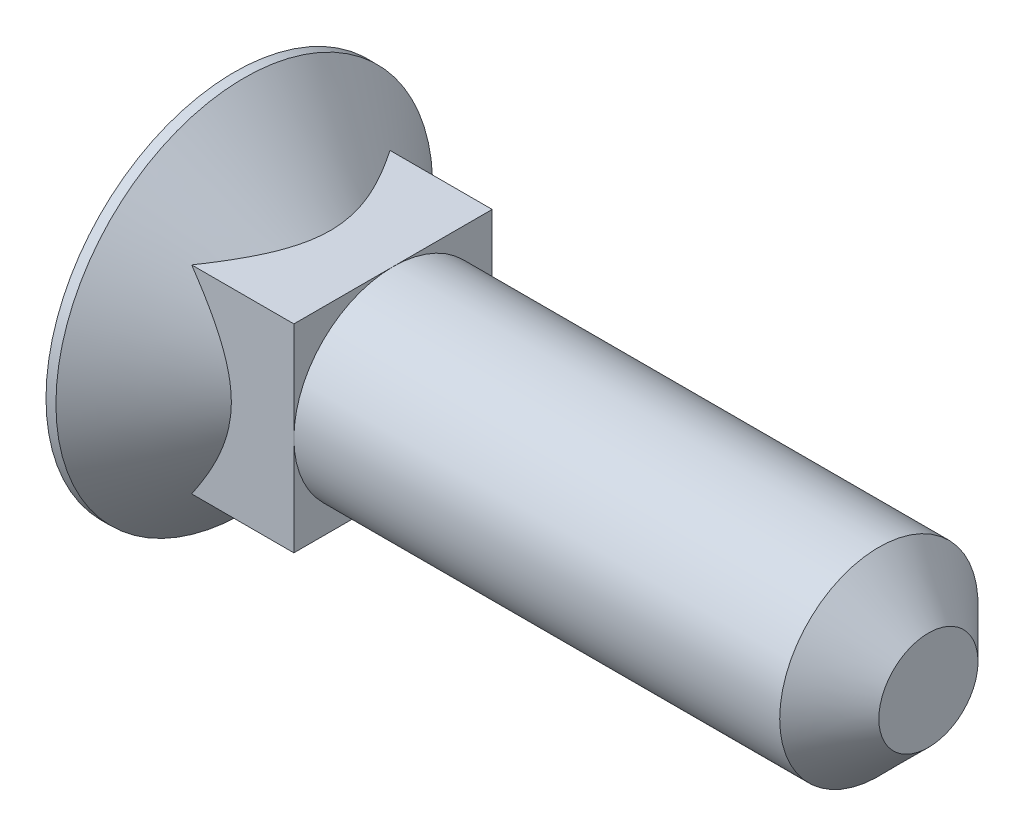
ISO-10303-21;
HEADER;
FILE_DESCRIPTION(('STEP AP214'),'2;1');
FILE_NAME('part.step','',(''),(''),'','','');
FILE_SCHEMA(('AUTOMOTIVE_DESIGN { 1 0 10303 214 1 1 1 1 }'));
ENDSEC;
DATA;
#1=APPLICATION_CONTEXT('core data for automotive mechanical design processes');
#2=APPLICATION_PROTOCOL_DEFINITION('international standard','automotive_design',2000,#1);
#3=PRODUCT_CONTEXT('',#1,'mechanical');
#4=PRODUCT('Part','Part','',(#3));
#5=PRODUCT_RELATED_PRODUCT_CATEGORY('part','',(#4));
#6=PRODUCT_DEFINITION_FORMATION('','',#4);
#7=PRODUCT_DEFINITION_CONTEXT('part definition',#1,'design');
#8=PRODUCT_DEFINITION('design','',#6,#7);
#9=PRODUCT_DEFINITION_SHAPE('','',#8);
#10=(LENGTH_UNIT() NAMED_UNIT(*) SI_UNIT(.MILLI.,.METRE.));
#11=(NAMED_UNIT(*) PLANE_ANGLE_UNIT() SI_UNIT($,.RADIAN.));
#12=(NAMED_UNIT(*) SI_UNIT($,.STERADIAN.) SOLID_ANGLE_UNIT());
#13=UNCERTAINTY_MEASURE_WITH_UNIT(LENGTH_MEASURE(1.E-05),#10,'distance_accuracy_value','');
#14=(GEOMETRIC_REPRESENTATION_CONTEXT(3) GLOBAL_UNCERTAINTY_ASSIGNED_CONTEXT((#13)) GLOBAL_UNIT_ASSIGNED_CONTEXT((#10,
#11,#12)) REPRESENTATION_CONTEXT('',''));
#15=CARTESIAN_POINT('',(0.,0.,0.));
#16=DIRECTION('',(0.,0.,1.));
#17=DIRECTION('',(1.,0.,0.));
#18=AXIS2_PLACEMENT_3D('',#15,#16,#17);
#19=CARTESIAN_POINT('',(4.84559948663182,0.,0.));
#20=DIRECTION('',(-1.,0.,0.));
#21=DIRECTION('',(0.,0.,1.));
#22=AXIS2_PLACEMENT_3D('',#19,#20,#21);
#23=CONICAL_SURFACE('',#22,5.,0.802851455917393);
#24=CARTESIAN_POINT('',(0.5,0.,0.));
#25=DIRECTION('',(-1.,0.,0.));
#26=DIRECTION('',(0.,0.,1.));
#27=AXIS2_PLACEMENT_3D('',#24,#25,#26);
#28=CIRCLE('',#27,9.5);
#29=CARTESIAN_POINT('',(0.5,0.,9.5));
#30=VERTEX_POINT('',#29);
#31=EDGE_CURVE('E169',#30,#30,#28,.T.);
#32=ORIENTED_EDGE('',*,*,#31,.F.);
#33=EDGE_LOOP('',(#32));
#34=FACE_BOUND('',#33,.T.);
#35=CARTESIAN_POINT('',(-0.712879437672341,-9.52318036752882,5.));
#36=CARTESIAN_POINT('',(-0.521841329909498,-9.29970864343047,5.));
#37=CARTESIAN_POINT('',(-0.331604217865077,-9.07554518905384,5.));
#38=CARTESIAN_POINT('',(0.0468371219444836,-8.62546566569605,5.));
#39=CARTESIAN_POINT('',(0.235041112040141,-8.39954939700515,5.));
#40=CARTESIAN_POINT('',(0.609827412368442,-7.94457044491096,5.));
#41=CARTESIAN_POINT('',(0.796397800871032,-7.71549792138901,5.));
#42=CARTESIAN_POINT('',(1.16634363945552,-7.25480211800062,5.));
#43=CARTESIAN_POINT('',(1.34971925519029,-7.02317897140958,5.));
#44=CARTESIAN_POINT('',(1.72370413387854,-6.54223881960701,5.));
#45=CARTESIAN_POINT('',(1.91405255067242,-6.29271831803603,5.));
#46=CARTESIAN_POINT('',(2.2887107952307,-5.78910009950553,5.));
#47=CARTESIAN_POINT('',(2.47301966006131,-5.53500166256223,5.));
#48=CARTESIAN_POINT('',(2.83301836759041,-5.02149983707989,5.));
#49=CARTESIAN_POINT('',(3.00872474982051,-4.76210810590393,5.));
#50=CARTESIAN_POINT('',(3.34861760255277,-4.23592686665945,5.));
#51=CARTESIAN_POINT('',(3.51280858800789,-3.96914031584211,5.));
#52=CARTESIAN_POINT('',(3.77814246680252,-3.50700655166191,5.));
#53=CARTESIAN_POINT('',(3.8834844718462,-3.31408325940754,5.));
#54=CARTESIAN_POINT('',(4.0835205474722,-2.92265884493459,5.));
#55=CARTESIAN_POINT('',(4.17821157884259,-2.72415615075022,5.));
#56=CARTESIAN_POINT('',(4.35275849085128,-2.32287609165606,5.));
#57=CARTESIAN_POINT('',(4.43274568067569,-2.12015658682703,5.));
#58=CARTESIAN_POINT('',(4.57485617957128,-1.70852630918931,5.));
#59=CARTESIAN_POINT('',(4.63699011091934,-1.49961929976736,5.));
#60=CARTESIAN_POINT('',(4.72438674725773,-1.13683360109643,5.));
#61=CARTESIAN_POINT('',(4.75511165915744,-0.984273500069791,5.));
#62=CARTESIAN_POINT('',(4.80371991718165,-0.677110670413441,5.));
#63=CARTESIAN_POINT('',(4.82160564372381,-0.522508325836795,5.));
#64=CARTESIAN_POINT('',(4.84353473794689,-0.212622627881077,5.));
#65=CARTESIAN_POINT('',(4.84760579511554,-0.0573412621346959,5.));
#66=CARTESIAN_POINT('',(4.84174563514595,0.252961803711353,5.));
#67=CARTESIAN_POINT('',(4.83181364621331,0.407983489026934,5.));
#68=CARTESIAN_POINT('',(4.79860012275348,0.7157873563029,5.));
#69=CARTESIAN_POINT('',(4.77538507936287,0.868576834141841,5.));
#70=CARTESIAN_POINT('',(4.71684378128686,1.17182606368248,5.));
#71=CARTESIAN_POINT('',(4.6815142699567,1.32228517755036,5.));
#72=CARTESIAN_POINT('',(4.60013519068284,1.62082214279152,5.));
#73=CARTESIAN_POINT('',(4.55404756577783,1.76888949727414,5.));
#74=CARTESIAN_POINT('',(4.45284240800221,2.06185461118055,5.));
#75=CARTESIAN_POINT('',(4.39772561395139,2.20675262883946,5.));
#76=CARTESIAN_POINT('',(4.24787505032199,2.57156968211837,5.));
#77=CARTESIAN_POINT('',(4.14792062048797,2.78933876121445,5.));
#78=CARTESIAN_POINT('',(3.93461740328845,3.21826395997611,5.));
#79=CARTESIAN_POINT('',(3.82125990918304,3.42941566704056,5.));
#80=CARTESIAN_POINT('',(3.58429143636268,3.84651466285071,5.));
#81=CARTESIAN_POINT('',(3.46065633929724,4.05244814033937,5.));
#82=CARTESIAN_POINT('',(3.20586124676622,4.45950488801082,5.));
#83=CARTESIAN_POINT('',(3.0747029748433,4.66062924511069,5.));
#84=CARTESIAN_POINT('',(2.80474906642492,5.06170686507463,5.));
#85=CARTESIAN_POINT('',(2.66587309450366,5.26160580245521,5.));
#86=CARTESIAN_POINT('',(2.38349195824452,5.65810728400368,5.));
#87=CARTESIAN_POINT('',(2.2399865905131,5.85470968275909,5.));
#88=CARTESIAN_POINT('',(1.9495427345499,6.24489291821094,5.));
#89=CARTESIAN_POINT('',(1.80260976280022,6.43847787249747,5.));
#90=CARTESIAN_POINT('',(1.50582587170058,6.82338408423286,5.));
#91=CARTESIAN_POINT('',(1.35597503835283,7.01470540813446,5.));
#92=CARTESIAN_POINT('',(1.05664903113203,7.39198956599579,5.));
#93=CARTESIAN_POINT('',(0.907216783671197,7.5779865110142,5.));
#94=CARTESIAN_POINT('',(0.606453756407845,7.94844020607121,5.));
#95=CARTESIAN_POINT('',(0.455122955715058,8.13289693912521,5.));
#96=CARTESIAN_POINT('',(-0.00124825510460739,8.68432822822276,5.));
#97=CARTESIAN_POINT('',(-0.308653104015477,9.04934589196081,5.));
#98=CARTESIAN_POINT('',(-0.928030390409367,9.77559507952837,5.));
#99=CARTESIAN_POINT('',(-1.24000372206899,10.1368258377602,5.));
#100=CARTESIAN_POINT('',(-1.86731470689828,10.8563578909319,5.));
#101=CARTESIAN_POINT('',(-2.18265239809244,11.2146591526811,5.));
#102=CARTESIAN_POINT('',(-2.81632437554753,11.9294785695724,5.));
#103=CARTESIAN_POINT('',(-3.13466218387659,12.2859935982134,5.));
#104=CARTESIAN_POINT('',(-3.77334852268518,12.9972201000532,5.));
#105=CARTESIAN_POINT('',(-4.09369706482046,13.3519315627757,5.));
#106=CARTESIAN_POINT('',(-5.05703301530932,14.413824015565,5.));
#107=CARTESIAN_POINT('',(-5.7023913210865,15.1188534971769,5.));
#108=CARTESIAN_POINT('',(-6.93839159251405,16.4611323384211,5.));
#109=CARTESIAN_POINT('',(-7.52867241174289,17.0987150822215,5.));
#110=CARTESIAN_POINT('',(-8.71175068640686,18.3715850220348,5.));
#111=CARTESIAN_POINT('',(-9.30454823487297,19.0068721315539,5.));
#112=CARTESIAN_POINT('',(-10.4906897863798,20.2743347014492,5.));
#113=CARTESIAN_POINT('',(-11.0840297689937,20.9065139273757,5.));
#114=CARTESIAN_POINT('',(-12.2721116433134,22.1695011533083,5.));
#115=CARTESIAN_POINT('',(-12.8668534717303,22.8003092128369,5.));
#116=CARTESIAN_POINT('',(-13.4621060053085,23.4306333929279,5.));
#117=B_SPLINE_CURVE_WITH_KNOTS('',3,(#35,#36,#37,#38,#39,#40,#41,#42,#43,#44,#45,#46,#47,#48,
#49,#50,#51,#52,#53,#54,#55,#56,#57,#58,#59,#60,#61,#62,#63,#64,#65,#66,#67,#68,#69,#70,#71,#72,
#73,#74,#75,#76,#77,#78,#79,#80,#81,#82,#83,#84,#85,#86,#87,#88,#89,#90,#91,#92,#93,#94,#95,#96,
#97,#98,#99,#100,#101,#102,#103,#104,#105,#106,#107,#108,#109,#110,#111,#112,#113,#114,#115,
#116),.UNSPECIFIED.,.F.,.F.,(4,2,2,2,2,2,2,2,2,2,2,2,2,2,2,2,2,2,2,2,2,2,2,2,2,2,2,2,2,2,2,2,2,
2,2,2,2,2,2,2,4),(0.,0.88200178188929,1.7641055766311,2.65039222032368,3.53663277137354,
4.47807296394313,5.41966253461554,6.35936429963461,7.2986955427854,7.95787956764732,
8.61725121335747,9.27041336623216,9.9231860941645,10.3895809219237,10.8558892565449,
11.3212623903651,11.7866611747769,12.2497504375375,12.7129642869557,13.1778422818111,
13.642682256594,14.3608492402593,15.0794853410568,15.7998582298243,16.5200667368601,
17.2501993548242,17.9803640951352,18.7094252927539,19.4384650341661,20.154218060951,
20.8699789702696,22.3015698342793,23.7334447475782,25.1653358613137,26.599194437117,
28.0330613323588,30.9004317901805,33.5070489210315,36.1137632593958,38.7147850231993,
41.315691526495),.UNSPECIFIED.);
#118=CARTESIAN_POINT('',(2.84559254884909,5.,5.));
#119=VERTEX_POINT('',#118);
#120=CARTESIAN_POINT('',(2.84559254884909,-5.,5.));
#121=VERTEX_POINT('',#120);
#122=EDGE_CURVE('E55',#119,#121,#117,.F.);
#123=ORIENTED_EDGE('',*,*,#122,.F.);
#124=CARTESIAN_POINT('',(-0.712879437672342,5.,-9.52318036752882));
#125=CARTESIAN_POINT('',(-0.521841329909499,5.,-9.29970864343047));
#126=CARTESIAN_POINT('',(-0.331604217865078,5.,-9.07554518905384));
#127=CARTESIAN_POINT('',(0.0468371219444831,5.,-8.62546566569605));
#128=CARTESIAN_POINT('',(0.235041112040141,5.,-8.39954939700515));
#129=CARTESIAN_POINT('',(0.609827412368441,5.,-7.94457044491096));
#130=CARTESIAN_POINT('',(0.796397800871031,5.,-7.71549792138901));
#131=CARTESIAN_POINT('',(1.16634363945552,5.,-7.25480211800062));
#132=CARTESIAN_POINT('',(1.34971925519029,5.,-7.02317897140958));
#133=CARTESIAN_POINT('',(1.72370413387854,5.,-6.54223881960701));
#134=CARTESIAN_POINT('',(1.91405255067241,5.,-6.29271831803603));
#135=CARTESIAN_POINT('',(2.2887107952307,5.,-5.78910009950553));
#136=CARTESIAN_POINT('',(2.47301966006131,5.,-5.53500166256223));
#137=CARTESIAN_POINT('',(2.83301836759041,5.,-5.02149983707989));
#138=CARTESIAN_POINT('',(3.00872474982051,5.,-4.76210810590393));
#139=CARTESIAN_POINT('',(3.34861760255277,5.,-4.23592686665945));
#140=CARTESIAN_POINT('',(3.51280858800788,5.,-3.96914031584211));
#141=CARTESIAN_POINT('',(3.77814246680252,5.,-3.50700655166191));
#142=CARTESIAN_POINT('',(3.8834844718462,5.,-3.31408325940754));
#143=CARTESIAN_POINT('',(4.0835205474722,5.,-2.92265884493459));
#144=CARTESIAN_POINT('',(4.17821157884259,5.,-2.72415615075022));
#145=CARTESIAN_POINT('',(4.35275849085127,5.,-2.32287609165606));
#146=CARTESIAN_POINT('',(4.43274568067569,5.,-2.12015658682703));
#147=CARTESIAN_POINT('',(4.57485617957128,5.,-1.70852630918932));
#148=CARTESIAN_POINT('',(4.63699011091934,5.,-1.49961929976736));
#149=CARTESIAN_POINT('',(4.72438674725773,5.,-1.13683360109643));
#150=CARTESIAN_POINT('',(4.75511165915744,5.,-0.984273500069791));
#151=CARTESIAN_POINT('',(4.80371991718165,5.,-0.677110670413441));
#152=CARTESIAN_POINT('',(4.82160564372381,5.,-0.522508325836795));
#153=CARTESIAN_POINT('',(4.84353473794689,5.,-0.212622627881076));
#154=CARTESIAN_POINT('',(4.84760579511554,5.,-0.0573412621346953));
#155=CARTESIAN_POINT('',(4.84174563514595,5.,0.252961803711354));
#156=CARTESIAN_POINT('',(4.83181364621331,5.,0.407983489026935));
#157=CARTESIAN_POINT('',(4.79860012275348,5.,0.715787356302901));
#158=CARTESIAN_POINT('',(4.77538507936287,5.,0.868576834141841));
#159=CARTESIAN_POINT('',(4.71684378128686,5.,1.17182606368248));
#160=CARTESIAN_POINT('',(4.6815142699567,5.,1.32228517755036));
#161=CARTESIAN_POINT('',(4.60013519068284,5.,1.62082214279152));
#162=CARTESIAN_POINT('',(4.55404756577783,5.,1.76888949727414));
#163=CARTESIAN_POINT('',(4.4528424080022,5.,2.06185461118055));
#164=CARTESIAN_POINT('',(4.39772561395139,5.,2.20675262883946));
#165=CARTESIAN_POINT('',(4.24787505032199,5.,2.57156968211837));
#166=CARTESIAN_POINT('',(4.14792062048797,5.,2.78933876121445));
#167=CARTESIAN_POINT('',(3.93461740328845,5.,3.21826395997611));
#168=CARTESIAN_POINT('',(3.82125990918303,5.,3.42941566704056));
#169=CARTESIAN_POINT('',(3.58429143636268,5.,3.84651466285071));
#170=CARTESIAN_POINT('',(3.46065633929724,5.,4.05244814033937));
#171=CARTESIAN_POINT('',(3.20586124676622,5.,4.45950488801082));
#172=CARTESIAN_POINT('',(3.0747029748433,5.,4.66062924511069));
#173=CARTESIAN_POINT('',(2.80474906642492,5.,5.06170686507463));
#174=CARTESIAN_POINT('',(2.66587309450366,5.,5.26160580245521));
#175=CARTESIAN_POINT('',(2.38349195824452,5.,5.65810728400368));
#176=CARTESIAN_POINT('',(2.2399865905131,5.,5.85470968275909));
#177=CARTESIAN_POINT('',(1.9495427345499,5.,6.24489291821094));
#178=CARTESIAN_POINT('',(1.80260976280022,5.,6.43847787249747));
#179=CARTESIAN_POINT('',(1.50582587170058,5.,6.82338408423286));
#180=CARTESIAN_POINT('',(1.35597503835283,5.,7.01470540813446));
#181=CARTESIAN_POINT('',(1.05664903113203,5.,7.39198956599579));
#182=CARTESIAN_POINT('',(0.907216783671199,5.,7.5779865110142));
#183=CARTESIAN_POINT('',(0.606453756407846,5.,7.94844020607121));
#184=CARTESIAN_POINT('',(0.455122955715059,5.,8.13289693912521));
#185=CARTESIAN_POINT('',(-0.00124825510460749,5.,8.68432822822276));
#186=CARTESIAN_POINT('',(-0.308653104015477,5.,9.04934589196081));
#187=CARTESIAN_POINT('',(-0.928030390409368,5.,9.77559507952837));
#188=CARTESIAN_POINT('',(-1.24000372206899,5.,10.1368258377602));
#189=CARTESIAN_POINT('',(-1.86731470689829,5.,10.8563578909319));
#190=CARTESIAN_POINT('',(-2.18265239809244,5.,11.2146591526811));
#191=CARTESIAN_POINT('',(-2.81632437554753,5.,11.9294785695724));
#192=CARTESIAN_POINT('',(-3.13466218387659,5.,12.2859935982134));
#193=CARTESIAN_POINT('',(-3.77334852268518,5.,12.9972201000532));
#194=CARTESIAN_POINT('',(-4.09369706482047,5.,13.3519315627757));
#195=CARTESIAN_POINT('',(-5.05703301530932,5.,14.4138240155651));
#196=CARTESIAN_POINT('',(-5.70239132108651,5.,15.1188534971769));
#197=CARTESIAN_POINT('',(-6.93839159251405,5.,16.4611323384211));
#198=CARTESIAN_POINT('',(-7.52867241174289,5.,17.0987150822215));
#199=CARTESIAN_POINT('',(-8.71175068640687,5.,18.3715850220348));
#200=CARTESIAN_POINT('',(-9.30454823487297,5.,19.0068721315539));
#201=CARTESIAN_POINT('',(-10.4906897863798,5.,20.2743347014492));
#202=CARTESIAN_POINT('',(-11.0840297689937,5.,20.9065139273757));
#203=CARTESIAN_POINT('',(-12.2721116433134,5.,22.1695011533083));
#204=CARTESIAN_POINT('',(-12.8668534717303,5.,22.8003092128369));
#205=CARTESIAN_POINT('',(-13.4621060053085,5.,23.4306333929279));
#206=B_SPLINE_CURVE_WITH_KNOTS('',3,(#124,#125,#126,#127,#128,#129,#130,#131,#132,#133,#134,
#135,#136,#137,#138,#139,#140,#141,#142,#143,#144,#145,#146,#147,#148,#149,#150,#151,#152,#153,
#154,#155,#156,#157,#158,#159,#160,#161,#162,#163,#164,#165,#166,#167,#168,#169,#170,#171,#172,
#173,#174,#175,#176,#177,#178,#179,#180,#181,#182,#183,#184,#185,#186,#187,#188,#189,#190,#191,
#192,#193,#194,#195,#196,#197,#198,#199,#200,#201,#202,#203,#204,#205),.UNSPECIFIED.,.F.,.F.,(4,
2,2,2,2,2,2,2,2,2,2,2,2,2,2,2,2,2,2,2,2,2,2,2,2,2,2,2,2,2,2,2,2,2,2,2,2,2,2,2,4),(0.,
0.88200178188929,1.7641055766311,2.65039222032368,3.53663277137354,4.47807296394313,
5.41966253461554,6.35936429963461,7.2986955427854,7.95787956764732,8.61725121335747,
9.27041336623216,9.9231860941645,10.3895809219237,10.8558892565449,11.3212623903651,
11.7866611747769,12.2497504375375,12.7129642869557,13.1778422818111,13.642682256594,
14.3608492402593,15.0794853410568,15.7998582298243,16.5200667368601,17.2501993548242,
17.9803640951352,18.7094252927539,19.4384650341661,20.154218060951,20.8699789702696,
22.3015698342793,23.7334447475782,25.1653358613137,26.599194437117,28.0330613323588,
30.9004317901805,33.5070489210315,36.1137632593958,38.7147850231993,41.315691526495),.UNSPECIFIED.);
#207=CARTESIAN_POINT('',(2.84559254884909,5.,-5.));
#208=VERTEX_POINT('',#207);
#209=EDGE_CURVE('E113',#208,#119,#206,.T.);
#210=ORIENTED_EDGE('',*,*,#209,.F.);
#211=CARTESIAN_POINT('',(-0.712879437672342,-9.52318036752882,-5.));
#212=CARTESIAN_POINT('',(-0.521841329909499,-9.29970864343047,-5.));
#213=CARTESIAN_POINT('',(-0.331604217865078,-9.07554518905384,-5.));
#214=CARTESIAN_POINT('',(0.0468371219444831,-8.62546566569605,-5.));
#215=CARTESIAN_POINT('',(0.235041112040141,-8.39954939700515,-5.));
#216=CARTESIAN_POINT('',(0.609827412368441,-7.94457044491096,-5.));
#217=CARTESIAN_POINT('',(0.796397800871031,-7.71549792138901,-5.));
#218=CARTESIAN_POINT('',(1.16634363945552,-7.25480211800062,-5.));
#219=CARTESIAN_POINT('',(1.34971925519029,-7.02317897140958,-5.));
#220=CARTESIAN_POINT('',(1.72370413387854,-6.54223881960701,-5.));
#221=CARTESIAN_POINT('',(1.91405255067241,-6.29271831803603,-5.));
#222=CARTESIAN_POINT('',(2.2887107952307,-5.78910009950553,-5.));
#223=CARTESIAN_POINT('',(2.47301966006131,-5.53500166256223,-5.));
#224=CARTESIAN_POINT('',(2.83301836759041,-5.02149983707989,-5.));
#225=CARTESIAN_POINT('',(3.00872474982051,-4.76210810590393,-5.));
#226=CARTESIAN_POINT('',(3.34861760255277,-4.23592686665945,-5.));
#227=CARTESIAN_POINT('',(3.51280858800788,-3.96914031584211,-5.));
#228=CARTESIAN_POINT('',(3.77814246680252,-3.50700655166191,-5.));
#229=CARTESIAN_POINT('',(3.8834844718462,-3.31408325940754,-5.));
#230=CARTESIAN_POINT('',(4.0835205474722,-2.92265884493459,-5.));
#231=CARTESIAN_POINT('',(4.17821157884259,-2.72415615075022,-5.));
#232=CARTESIAN_POINT('',(4.35275849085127,-2.32287609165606,-5.));
#233=CARTESIAN_POINT('',(4.43274568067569,-2.12015658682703,-5.));
#234=CARTESIAN_POINT('',(4.57485617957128,-1.70852630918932,-5.));
#235=CARTESIAN_POINT('',(4.63699011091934,-1.49961929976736,-5.));
#236=CARTESIAN_POINT('',(4.72438674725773,-1.13683360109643,-5.));
#237=CARTESIAN_POINT('',(4.75511165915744,-0.984273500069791,-5.));
#238=CARTESIAN_POINT('',(4.80371991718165,-0.677110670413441,-5.));
#239=CARTESIAN_POINT('',(4.82160564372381,-0.522508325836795,-5.));
#240=CARTESIAN_POINT('',(4.84353473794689,-0.212622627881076,-5.));
#241=CARTESIAN_POINT('',(4.84760579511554,-0.0573412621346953,-5.));
#242=CARTESIAN_POINT('',(4.84174563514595,0.252961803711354,-5.));
#243=CARTESIAN_POINT('',(4.83181364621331,0.407983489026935,-5.));
#244=CARTESIAN_POINT('',(4.79860012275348,0.715787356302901,-5.));
#245=CARTESIAN_POINT('',(4.77538507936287,0.868576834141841,-5.));
#246=CARTESIAN_POINT('',(4.71684378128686,1.17182606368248,-5.));
#247=CARTESIAN_POINT('',(4.6815142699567,1.32228517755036,-5.));
#248=CARTESIAN_POINT('',(4.60013519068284,1.62082214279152,-5.));
#249=CARTESIAN_POINT('',(4.55404756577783,1.76888949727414,-5.));
#250=CARTESIAN_POINT('',(4.4528424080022,2.06185461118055,-5.));
#251=CARTESIAN_POINT('',(4.39772561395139,2.20675262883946,-5.));
#252=CARTESIAN_POINT('',(4.24787505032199,2.57156968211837,-5.));
#253=CARTESIAN_POINT('',(4.14792062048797,2.78933876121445,-5.));
#254=CARTESIAN_POINT('',(3.93461740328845,3.21826395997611,-5.));
#255=CARTESIAN_POINT('',(3.82125990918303,3.42941566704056,-5.));
#256=CARTESIAN_POINT('',(3.58429143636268,3.84651466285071,-5.));
#257=CARTESIAN_POINT('',(3.46065633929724,4.05244814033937,-5.));
#258=CARTESIAN_POINT('',(3.20586124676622,4.45950488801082,-5.));
#259=CARTESIAN_POINT('',(3.0747029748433,4.66062924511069,-5.));
#260=CARTESIAN_POINT('',(2.80474906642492,5.06170686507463,-5.));
#261=CARTESIAN_POINT('',(2.66587309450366,5.26160580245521,-5.));
#262=CARTESIAN_POINT('',(2.38349195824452,5.65810728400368,-5.));
#263=CARTESIAN_POINT('',(2.2399865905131,5.85470968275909,-5.));
#264=CARTESIAN_POINT('',(1.9495427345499,6.24489291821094,-5.));
#265=CARTESIAN_POINT('',(1.80260976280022,6.43847787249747,-5.));
#266=CARTESIAN_POINT('',(1.50582587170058,6.82338408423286,-5.));
#267=CARTESIAN_POINT('',(1.35597503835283,7.01470540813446,-5.));
#268=CARTESIAN_POINT('',(1.05664903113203,7.39198956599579,-5.));
#269=CARTESIAN_POINT('',(0.907216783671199,7.5779865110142,-5.));
#270=CARTESIAN_POINT('',(0.606453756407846,7.94844020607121,-5.));
#271=CARTESIAN_POINT('',(0.455122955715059,8.13289693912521,-5.));
#272=CARTESIAN_POINT('',(-0.00124825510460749,8.68432822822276,-5.));
#273=CARTESIAN_POINT('',(-0.308653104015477,9.04934589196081,-5.));
#274=CARTESIAN_POINT('',(-0.928030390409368,9.77559507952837,-5.));
#275=CARTESIAN_POINT('',(-1.24000372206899,10.1368258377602,-5.));
#276=CARTESIAN_POINT('',(-1.86731470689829,10.8563578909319,-5.));
#277=CARTESIAN_POINT('',(-2.18265239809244,11.2146591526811,-5.));
#278=CARTESIAN_POINT('',(-2.81632437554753,11.9294785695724,-5.));
#279=CARTESIAN_POINT('',(-3.13466218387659,12.2859935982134,-5.));
#280=CARTESIAN_POINT('',(-3.77334852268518,12.9972201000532,-5.));
#281=CARTESIAN_POINT('',(-4.09369706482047,13.3519315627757,-5.));
#282=CARTESIAN_POINT('',(-5.05703301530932,14.4138240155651,-5.));
#283=CARTESIAN_POINT('',(-5.70239132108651,15.1188534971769,-5.));
#284=CARTESIAN_POINT('',(-6.93839159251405,16.4611323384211,-5.));
#285=CARTESIAN_POINT('',(-7.52867241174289,17.0987150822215,-5.));
#286=CARTESIAN_POINT('',(-8.71175068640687,18.3715850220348,-5.));
#287=CARTESIAN_POINT('',(-9.30454823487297,19.0068721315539,-5.));
#288=CARTESIAN_POINT('',(-10.4906897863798,20.2743347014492,-5.));
#289=CARTESIAN_POINT('',(-11.0840297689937,20.9065139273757,-5.));
#290=CARTESIAN_POINT('',(-12.2721116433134,22.1695011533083,-5.));
#291=CARTESIAN_POINT('',(-12.8668534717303,22.8003092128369,-5.));
#292=CARTESIAN_POINT('',(-13.4621060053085,23.4306333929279,-5.));
#293=B_SPLINE_CURVE_WITH_KNOTS('',3,(#211,#212,#213,#214,#215,#216,#217,#218,#219,#220,#221,
#222,#223,#224,#225,#226,#227,#228,#229,#230,#231,#232,#233,#234,#235,#236,#237,#238,#239,#240,
#241,#242,#243,#244,#245,#246,#247,#248,#249,#250,#251,#252,#253,#254,#255,#256,#257,#258,#259,
#260,#261,#262,#263,#264,#265,#266,#267,#268,#269,#270,#271,#272,#273,#274,#275,#276,#277,#278,
#279,#280,#281,#282,#283,#284,#285,#286,#287,#288,#289,#290,#291,#292),.UNSPECIFIED.,.F.,.F.,(4,
2,2,2,2,2,2,2,2,2,2,2,2,2,2,2,2,2,2,2,2,2,2,2,2,2,2,2,2,2,2,2,2,2,2,2,2,2,2,2,4),(0.,
0.88200178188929,1.7641055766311,2.65039222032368,3.53663277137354,4.47807296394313,
5.41966253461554,6.35936429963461,7.2986955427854,7.95787956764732,8.61725121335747,
9.27041336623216,9.9231860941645,10.3895809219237,10.8558892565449,11.3212623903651,
11.7866611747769,12.2497504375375,12.7129642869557,13.1778422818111,13.642682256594,
14.3608492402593,15.0794853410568,15.7998582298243,16.5200667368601,17.2501993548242,
17.9803640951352,18.7094252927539,19.4384650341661,20.154218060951,20.8699789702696,
22.3015698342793,23.7334447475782,25.1653358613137,26.599194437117,28.0330613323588,
30.9004317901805,33.5070489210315,36.1137632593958,38.7147850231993,41.315691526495),.UNSPECIFIED.);
#294=CARTESIAN_POINT('',(2.84559254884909,-5.,-5.));
#295=VERTEX_POINT('',#294);
#296=EDGE_CURVE('E116',#295,#208,#293,.T.);
#297=ORIENTED_EDGE('',*,*,#296,.F.);
#298=CARTESIAN_POINT('',(-0.712879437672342,-5.,-9.52318036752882));
#299=CARTESIAN_POINT('',(-0.521841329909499,-5.,-9.29970864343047));
#300=CARTESIAN_POINT('',(-0.331604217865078,-5.,-9.07554518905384));
#301=CARTESIAN_POINT('',(0.0468371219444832,-5.,-8.62546566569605));
#302=CARTESIAN_POINT('',(0.235041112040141,-5.,-8.39954939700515));
#303=CARTESIAN_POINT('',(0.609827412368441,-5.,-7.94457044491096));
#304=CARTESIAN_POINT('',(0.796397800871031,-5.,-7.71549792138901));
#305=CARTESIAN_POINT('',(1.16634363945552,-5.,-7.25480211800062));
#306=CARTESIAN_POINT('',(1.34971925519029,-5.,-7.02317897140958));
#307=CARTESIAN_POINT('',(1.72370413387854,-5.,-6.54223881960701));
#308=CARTESIAN_POINT('',(1.91405255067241,-5.,-6.29271831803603));
#309=CARTESIAN_POINT('',(2.2887107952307,-5.,-5.78910009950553));
#310=CARTESIAN_POINT('',(2.47301966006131,-5.,-5.53500166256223));
#311=CARTESIAN_POINT('',(2.83301836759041,-5.,-5.02149983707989));
#312=CARTESIAN_POINT('',(3.00872474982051,-5.,-4.76210810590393));
#313=CARTESIAN_POINT('',(3.34861760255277,-5.,-4.23592686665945));
#314=CARTESIAN_POINT('',(3.51280858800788,-5.,-3.96914031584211));
#315=CARTESIAN_POINT('',(3.77814246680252,-5.,-3.50700655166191));
#316=CARTESIAN_POINT('',(3.8834844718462,-5.,-3.31408325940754));
#317=CARTESIAN_POINT('',(4.0835205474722,-5.,-2.92265884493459));
#318=CARTESIAN_POINT('',(4.17821157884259,-5.,-2.72415615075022));
#319=CARTESIAN_POINT('',(4.35275849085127,-5.,-2.32287609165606));
#320=CARTESIAN_POINT('',(4.43274568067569,-5.,-2.12015658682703));
#321=CARTESIAN_POINT('',(4.57485617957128,-5.,-1.70852630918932));
#322=CARTESIAN_POINT('',(4.63699011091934,-5.,-1.49961929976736));
#323=CARTESIAN_POINT('',(4.72438674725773,-5.,-1.13683360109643));
#324=CARTESIAN_POINT('',(4.75511165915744,-5.,-0.984273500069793));
#325=CARTESIAN_POINT('',(4.80371991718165,-5.,-0.677110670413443));
#326=CARTESIAN_POINT('',(4.82160564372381,-5.,-0.522508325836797));
#327=CARTESIAN_POINT('',(4.84353473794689,-5.,-0.212622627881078));
#328=CARTESIAN_POINT('',(4.84760579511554,-5.,-0.0573412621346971));
#329=CARTESIAN_POINT('',(4.84174563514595,-5.,0.252961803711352));
#330=CARTESIAN_POINT('',(4.83181364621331,-5.,0.407983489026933));
#331=CARTESIAN_POINT('',(4.79860012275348,-5.,0.715787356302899));
#332=CARTESIAN_POINT('',(4.77538507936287,-5.,0.868576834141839));
#333=CARTESIAN_POINT('',(4.71684378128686,-5.,1.17182606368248));
#334=CARTESIAN_POINT('',(4.6815142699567,-5.,1.32228517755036));
#335=CARTESIAN_POINT('',(4.60013519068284,-5.,1.62082214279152));
#336=CARTESIAN_POINT('',(4.55404756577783,-5.,1.76888949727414));
#337=CARTESIAN_POINT('',(4.45284240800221,-5.,2.06185461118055));
#338=CARTESIAN_POINT('',(4.39772561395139,-5.,2.20675262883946));
#339=CARTESIAN_POINT('',(4.24787505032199,-5.,2.57156968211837));
#340=CARTESIAN_POINT('',(4.14792062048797,-5.,2.78933876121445));
#341=CARTESIAN_POINT('',(3.93461740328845,-5.,3.2182639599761));
#342=CARTESIAN_POINT('',(3.82125990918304,-5.,3.42941566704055));
#343=CARTESIAN_POINT('',(3.58429143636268,-5.,3.8465146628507));
#344=CARTESIAN_POINT('',(3.46065633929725,-5.,4.05244814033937));
#345=CARTESIAN_POINT('',(3.20586124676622,-5.,4.45950488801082));
#346=CARTESIAN_POINT('',(3.07470297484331,-5.,4.66062924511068));
#347=CARTESIAN_POINT('',(2.80474906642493,-5.,5.06170686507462));
#348=CARTESIAN_POINT('',(2.66587309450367,-5.,5.26160580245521));
#349=CARTESIAN_POINT('',(2.38349195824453,-5.,5.65810728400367));
#350=CARTESIAN_POINT('',(2.2399865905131,-5.,5.85470968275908));
#351=CARTESIAN_POINT('',(1.94954273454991,-5.,6.24489291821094));
#352=CARTESIAN_POINT('',(1.80260976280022,-5.,6.43847787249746));
#353=CARTESIAN_POINT('',(1.50582587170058,-5.,6.82338408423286));
#354=CARTESIAN_POINT('',(1.35597503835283,-5.,7.01470540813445));
#355=CARTESIAN_POINT('',(1.05664903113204,-5.,7.39198956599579));
#356=CARTESIAN_POINT('',(0.907216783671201,-5.,7.57798651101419));
#357=CARTESIAN_POINT('',(0.606453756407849,-5.,7.9484402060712));
#358=CARTESIAN_POINT('',(0.455122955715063,-5.,8.13289693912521));
#359=CARTESIAN_POINT('',(-0.0012482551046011,-5.,8.68432822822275));
#360=CARTESIAN_POINT('',(-0.308653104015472,-5.,9.0493458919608));
#361=CARTESIAN_POINT('',(-0.928030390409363,-5.,9.77559507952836));
#362=CARTESIAN_POINT('',(-1.24000372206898,-5.,10.1368258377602));
#363=CARTESIAN_POINT('',(-1.86731470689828,-5.,10.8563578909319));
#364=CARTESIAN_POINT('',(-2.18265239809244,-5.,11.2146591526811));
#365=CARTESIAN_POINT('',(-2.81632437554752,-5.,11.9294785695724));
#366=CARTESIAN_POINT('',(-3.13466218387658,-5.,12.2859935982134));
#367=CARTESIAN_POINT('',(-3.77334852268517,-5.,12.9972201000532));
#368=CARTESIAN_POINT('',(-4.09369706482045,-5.,13.3519315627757));
#369=CARTESIAN_POINT('',(-5.05703301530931,-5.,14.413824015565));
#370=CARTESIAN_POINT('',(-5.7023913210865,-5.,15.1188534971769));
#371=CARTESIAN_POINT('',(-6.93839159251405,-5.,16.4611323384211));
#372=CARTESIAN_POINT('',(-7.52867241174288,-5.,17.0987150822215));
#373=CARTESIAN_POINT('',(-8.71175068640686,-5.,18.3715850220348));
#374=CARTESIAN_POINT('',(-9.30454823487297,-5.,19.0068721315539));
#375=CARTESIAN_POINT('',(-10.4906897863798,-5.,20.2743347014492));
#376=CARTESIAN_POINT('',(-11.0840297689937,-5.,20.9065139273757));
#377=CARTESIAN_POINT('',(-12.2721116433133,-5.,22.1695011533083));
#378=CARTESIAN_POINT('',(-12.8668534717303,-5.,22.8003092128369));
#379=CARTESIAN_POINT('',(-13.4621060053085,-5.,23.4306333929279));
#380=B_SPLINE_CURVE_WITH_KNOTS('',3,(#298,#299,#300,#301,#302,#303,#304,#305,#306,#307,#308,
#309,#310,#311,#312,#313,#314,#315,#316,#317,#318,#319,#320,#321,#322,#323,#324,#325,#326,#327,
#328,#329,#330,#331,#332,#333,#334,#335,#336,#337,#338,#339,#340,#341,#342,#343,#344,#345,#346,
#347,#348,#349,#350,#351,#352,#353,#354,#355,#356,#357,#358,#359,#360,#361,#362,#363,#364,#365,
#366,#367,#368,#369,#370,#371,#372,#373,#374,#375,#376,#377,#378,#379),.UNSPECIFIED.,.F.,.F.,(4,
2,2,2,2,2,2,2,2,2,2,2,2,2,2,2,2,2,2,2,2,2,2,2,2,2,2,2,2,2,2,2,2,2,2,2,2,2,2,2,4),(0.,
0.88200178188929,1.7641055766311,2.65039222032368,3.53663277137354,4.47807296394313,
5.41966253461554,6.35936429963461,7.2986955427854,7.95787956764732,8.61725121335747,
9.27041336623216,9.9231860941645,10.3895809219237,10.8558892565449,11.3212623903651,
11.7866611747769,12.2497504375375,12.7129642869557,13.1778422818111,13.642682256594,
14.3608492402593,15.0794853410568,15.7998582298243,16.5200667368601,17.2501993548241,
17.9803640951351,18.7094252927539,19.4384650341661,20.154218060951,20.8699789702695,
22.3015698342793,23.7334447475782,25.1653358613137,26.599194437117,28.0330613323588,
30.9004317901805,33.5070489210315,36.1137632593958,38.7147850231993,41.315691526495),.UNSPECIFIED.);
#381=EDGE_CURVE('E62',#121,#295,#380,.F.);
#382=ORIENTED_EDGE('',*,*,#381,.F.);
#383=EDGE_LOOP('',(#123,#210,#297,#382));
#384=FACE_BOUND('',#383,.T.);
#385=ADVANCED_FACE('F39',(#34,#384),#23,.T.);
#386=CARTESIAN_POINT('',(0.,0.,0.));
#387=DIRECTION('',(1.,0.,0.));
#388=DIRECTION('',(0.,0.,-1.));
#389=AXIS2_PLACEMENT_3D('',#386,#387,#388);
#390=PLANE('',#389);
#391=CARTESIAN_POINT('',(0.,0.,0.));
#392=DIRECTION('',(-1.,0.,0.));
#393=DIRECTION('',(0.,0.,1.));
#394=AXIS2_PLACEMENT_3D('',#391,#392,#393);
#395=CIRCLE('',#394,9.5);
#396=CARTESIAN_POINT('',(0.,0.,9.5));
#397=VERTEX_POINT('',#396);
#398=EDGE_CURVE('E171',#397,#397,#395,.T.);
#399=ORIENTED_EDGE('',*,*,#398,.T.);
#400=EDGE_LOOP('',(#399));
#401=FACE_BOUND('',#400,.T.);
#402=ADVANCED_FACE('F41',(#401),#390,.F.);
#403=CARTESIAN_POINT('',(0.,0.,0.));
#404=DIRECTION('',(-1.,0.,0.));
#405=DIRECTION('',(0.,0.,1.));
#406=AXIS2_PLACEMENT_3D('',#403,#404,#405);
#407=CYLINDRICAL_SURFACE('',#406,9.5);
#408=ORIENTED_EDGE('',*,*,#398,.F.);
#409=EDGE_LOOP('',(#408));
#410=FACE_BOUND('',#409,.T.);
#411=ORIENTED_EDGE('',*,*,#31,.T.);
#412=EDGE_LOOP('',(#411));
#413=FACE_BOUND('',#412,.T.);
#414=ADVANCED_FACE('F218',(#410,#413),#407,.T.);
#415=CARTESIAN_POINT('',(8.,5.,5.));
#416=DIRECTION('',(0.,0.,-1.));
#417=DIRECTION('',(0.,1.,0.));
#418=AXIS2_PLACEMENT_3D('',#415,#416,#417);
#419=PLANE('',#418);
#420=DIRECTION('',(-1.,0.,0.));
#421=VECTOR('',#420,1.);
#422=CARTESIAN_POINT('',(8.,5.,5.));
#423=LINE('',#422,#421);
#424=CARTESIAN_POINT('',(8.,5.,5.));
#425=VERTEX_POINT('',#424);
#426=EDGE_CURVE('E190',#425,#119,#423,.T.);
#427=ORIENTED_EDGE('',*,*,#426,.T.);
#428=ORIENTED_EDGE('',*,*,#122,.T.);
#429=DIRECTION('',(-1.,0.,0.));
#430=VECTOR('',#429,1.);
#431=CARTESIAN_POINT('',(8.,-5.,5.));
#432=LINE('',#431,#430);
#433=CARTESIAN_POINT('',(8.,-5.,5.));
#434=VERTEX_POINT('',#433);
#435=EDGE_CURVE('E108',#434,#121,#432,.T.);
#436=ORIENTED_EDGE('',*,*,#435,.F.);
#437=DIRECTION('',(0.,-1.,0.));
#438=VECTOR('',#437,1.);
#439=CARTESIAN_POINT('',(8.,5.,5.));
#440=LINE('',#439,#438);
#441=CARTESIAN_POINT('',(8.,0.,5.));
#442=VERTEX_POINT('',#441);
#443=EDGE_CURVE('E96',#442,#434,#440,.T.);
#444=ORIENTED_EDGE('',*,*,#443,.F.);
#445=EDGE_CURVE('E104',#425,#442,#440,.T.);
#446=ORIENTED_EDGE('',*,*,#445,.F.);
#447=EDGE_LOOP('',(#427,#428,#436,#444,#446));
#448=FACE_BOUND('',#447,.T.);
#449=ADVANCED_FACE('F112',(#448),#419,.F.);
#450=CARTESIAN_POINT('',(8.,-5.,5.));
#451=DIRECTION('',(0.,1.,0.));
#452=DIRECTION('',(0.,0.,1.));
#453=AXIS2_PLACEMENT_3D('',#450,#451,#452);
#454=PLANE('',#453);
#455=ORIENTED_EDGE('',*,*,#435,.T.);
#456=ORIENTED_EDGE('',*,*,#381,.T.);
#457=DIRECTION('',(-1.,0.,0.));
#458=VECTOR('',#457,1.);
#459=CARTESIAN_POINT('',(8.,-5.,-5.));
#460=LINE('',#459,#458);
#461=CARTESIAN_POINT('',(8.,-5.,-5.));
#462=VERTEX_POINT('',#461);
#463=EDGE_CURVE('E114',#462,#295,#460,.T.);
#464=ORIENTED_EDGE('',*,*,#463,.F.);
#465=DIRECTION('',(0.,0.,-1.));
#466=VECTOR('',#465,1.);
#467=CARTESIAN_POINT('',(8.,-5.,5.));
#468=LINE('',#467,#466);
#469=CARTESIAN_POINT('',(8.,-5.,0.));
#470=VERTEX_POINT('',#469);
#471=EDGE_CURVE('E109',#470,#462,#468,.T.);
#472=ORIENTED_EDGE('',*,*,#471,.F.);
#473=EDGE_CURVE('E99',#434,#470,#468,.T.);
#474=ORIENTED_EDGE('',*,*,#473,.F.);
#475=EDGE_LOOP('',(#455,#456,#464,#472,#474));
#476=FACE_BOUND('',#475,.T.);
#477=ADVANCED_FACE('F107',(#476),#454,.F.);
#478=CARTESIAN_POINT('',(8.,5.,-5.));
#479=DIRECTION('',(0.,0.,1.));
#480=DIRECTION('',(1.,0.,0.));
#481=AXIS2_PLACEMENT_3D('',#478,#479,#480);
#482=PLANE('',#481);
#483=ORIENTED_EDGE('',*,*,#463,.T.);
#484=ORIENTED_EDGE('',*,*,#296,.T.);
#485=DIRECTION('',(-1.,0.,0.));
#486=VECTOR('',#485,1.);
#487=CARTESIAN_POINT('',(8.,5.,-5.));
#488=LINE('',#487,#486);
#489=CARTESIAN_POINT('',(8.,5.,-5.));
#490=VERTEX_POINT('',#489);
#491=EDGE_CURVE('E119',#490,#208,#488,.T.);
#492=ORIENTED_EDGE('',*,*,#491,.F.);
#493=DIRECTION('',(0.,1.,0.));
#494=VECTOR('',#493,1.);
#495=CARTESIAN_POINT('',(8.,5.,-5.));
#496=LINE('',#495,#494);
#497=CARTESIAN_POINT('',(8.,0.,-5.));
#498=VERTEX_POINT('',#497);
#499=EDGE_CURVE('E110',#498,#490,#496,.T.);
#500=ORIENTED_EDGE('',*,*,#499,.F.);
#501=EDGE_CURVE('E191',#462,#498,#496,.T.);
#502=ORIENTED_EDGE('',*,*,#501,.F.);
#503=EDGE_LOOP('',(#483,#484,#492,#500,#502));
#504=FACE_BOUND('',#503,.T.);
#505=ADVANCED_FACE('F142',(#504),#482,.F.);
#506=CARTESIAN_POINT('',(8.,5.,5.));
#507=DIRECTION('',(0.,-1.,0.));
#508=DIRECTION('',(0.,0.,-1.));
#509=AXIS2_PLACEMENT_3D('',#506,#507,#508);
#510=PLANE('',#509);
#511=ORIENTED_EDGE('',*,*,#491,.T.);
#512=ORIENTED_EDGE('',*,*,#209,.T.);
#513=ORIENTED_EDGE('',*,*,#426,.F.);
#514=DIRECTION('',(0.,0.,1.));
#515=VECTOR('',#514,1.);
#516=CARTESIAN_POINT('',(8.,5.,5.));
#517=LINE('',#516,#515);
#518=CARTESIAN_POINT('',(8.,5.,0.));
#519=VERTEX_POINT('',#518);
#520=EDGE_CURVE('E184',#519,#425,#517,.T.);
#521=ORIENTED_EDGE('',*,*,#520,.F.);
#522=EDGE_CURVE('E189',#490,#519,#517,.T.);
#523=ORIENTED_EDGE('',*,*,#522,.F.);
#524=EDGE_LOOP('',(#511,#512,#513,#521,#523));
#525=FACE_BOUND('',#524,.T.);
#526=ADVANCED_FACE('F137',(#525),#510,.F.);
#527=CARTESIAN_POINT('',(8.,-5.,5.));
#528=DIRECTION('',(1.,0.,0.));
#529=DIRECTION('',(0.,0.,-1.));
#530=AXIS2_PLACEMENT_3D('',#527,#528,#529);
#531=PLANE('',#530);
#532=CARTESIAN_POINT('',(8.,0.,0.));
#533=DIRECTION('',(1.,0.,0.));
#534=DIRECTION('',(0.,0.,-1.));
#535=AXIS2_PLACEMENT_3D('',#532,#533,#534);
#536=CIRCLE('',#535,5.);
#537=EDGE_CURVE('E11',#498,#519,#536,.T.);
#538=ORIENTED_EDGE('',*,*,#537,.F.);
#539=ORIENTED_EDGE('',*,*,#499,.T.);
#540=ORIENTED_EDGE('',*,*,#522,.T.);
#541=EDGE_LOOP('',(#538,#539,#540));
#542=FACE_BOUND('',#541,.T.);
#543=ADVANCED_FACE('F141',(#542),#531,.T.);
#544=EDGE_CURVE('E48',#519,#442,#536,.T.);
#545=ORIENTED_EDGE('',*,*,#544,.F.);
#546=ORIENTED_EDGE('',*,*,#520,.T.);
#547=ORIENTED_EDGE('',*,*,#445,.T.);
#548=EDGE_LOOP('',(#545,#546,#547));
#549=FACE_BOUND('',#548,.T.);
#550=ADVANCED_FACE('F183',(#549),#531,.T.);
#551=EDGE_CURVE('E101',#442,#470,#536,.T.);
#552=ORIENTED_EDGE('',*,*,#551,.F.);
#553=ORIENTED_EDGE('',*,*,#443,.T.);
#554=ORIENTED_EDGE('',*,*,#473,.T.);
#555=EDGE_LOOP('',(#552,#553,#554));
#556=FACE_BOUND('',#555,.T.);
#557=ADVANCED_FACE('F98',(#556),#531,.T.);
#558=EDGE_CURVE('E43',#470,#498,#536,.T.);
#559=ORIENTED_EDGE('',*,*,#558,.F.);
#560=ORIENTED_EDGE('',*,*,#471,.T.);
#561=ORIENTED_EDGE('',*,*,#501,.T.);
#562=EDGE_LOOP('',(#559,#560,#561));
#563=FACE_BOUND('',#562,.T.);
#564=ADVANCED_FACE('F202',(#563),#531,.T.);
#565=CARTESIAN_POINT('',(35.,2.50000000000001,0.));
#566=DIRECTION('',(-1.,0.,0.));
#567=DIRECTION('',(0.,0.,1.));
#568=AXIS2_PLACEMENT_3D('',#565,#566,#567);
#569=PLANE('',#568);
#570=CARTESIAN_POINT('',(35.,0.,0.));
#571=DIRECTION('',(-1.,0.,0.));
#572=DIRECTION('',(0.,0.,1.));
#573=AXIS2_PLACEMENT_3D('',#570,#571,#572);
#574=CIRCLE('',#573,2.50000000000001);
#575=CARTESIAN_POINT('',(35.,0.,2.50000000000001));
#576=VERTEX_POINT('',#575);
#577=EDGE_CURVE('E163',#576,#576,#574,.T.);
#578=ORIENTED_EDGE('',*,*,#577,.F.);
#579=EDGE_LOOP('',(#578));
#580=FACE_BOUND('',#579,.T.);
#581=ADVANCED_FACE('F204',(#580),#569,.F.);
#582=CARTESIAN_POINT('',(35.,0.,0.));
#583=DIRECTION('',(-1.,0.,0.));
#584=DIRECTION('',(0.,0.,1.));
#585=AXIS2_PLACEMENT_3D('',#582,#583,#584);
#586=CONICAL_SURFACE('',#585,2.50000000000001,0.785398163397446);
#587=CARTESIAN_POINT('',(32.5,0.,0.));
#588=DIRECTION('',(-1.,0.,0.));
#589=DIRECTION('',(0.,0.,1.));
#590=AXIS2_PLACEMENT_3D('',#587,#588,#589);
#591=CIRCLE('',#590,5.);
#592=CARTESIAN_POINT('',(32.5,0.,5.));
#593=VERTEX_POINT('',#592);
#594=EDGE_CURVE('E166',#593,#593,#591,.T.);
#595=ORIENTED_EDGE('',*,*,#594,.F.);
#596=EDGE_LOOP('',(#595));
#597=FACE_BOUND('',#596,.T.);
#598=ORIENTED_EDGE('',*,*,#577,.T.);
#599=EDGE_LOOP('',(#598));
#600=FACE_BOUND('',#599,.T.);
#601=ADVANCED_FACE('F210',(#597,#600),#586,.T.);
#602=CARTESIAN_POINT('',(0.,0.,0.));
#603=DIRECTION('',(-1.,0.,0.));
#604=DIRECTION('',(0.,0.,1.));
#605=AXIS2_PLACEMENT_3D('',#602,#603,#604);
#606=CYLINDRICAL_SURFACE('',#605,5.);
#607=ORIENTED_EDGE('',*,*,#558,.T.);
#608=ORIENTED_EDGE('',*,*,#537,.T.);
#609=ORIENTED_EDGE('',*,*,#544,.T.);
#610=ORIENTED_EDGE('',*,*,#551,.T.);
#611=EDGE_LOOP('',(#607,#608,#609,#610));
#612=FACE_BOUND('',#611,.T.);
#613=ORIENTED_EDGE('',*,*,#594,.T.);
#614=EDGE_LOOP('',(#613));
#615=FACE_BOUND('',#614,.T.);
#616=ADVANCED_FACE('F178',(#612,#615),#606,.T.);
#617=CLOSED_SHELL('',(#385,#402,#414,#449,#477,#505,#526,#543,#550,#557,#564,#581,#601,#616));
#618=MANIFOLD_SOLID_BREP('B2',#617);
#619=ADVANCED_BREP_SHAPE_REPRESENTATION('',(#18,#618),#14);
#620=SHAPE_DEFINITION_REPRESENTATION(#9,#619);
ENDSEC;
END-ISO-10303-21;
